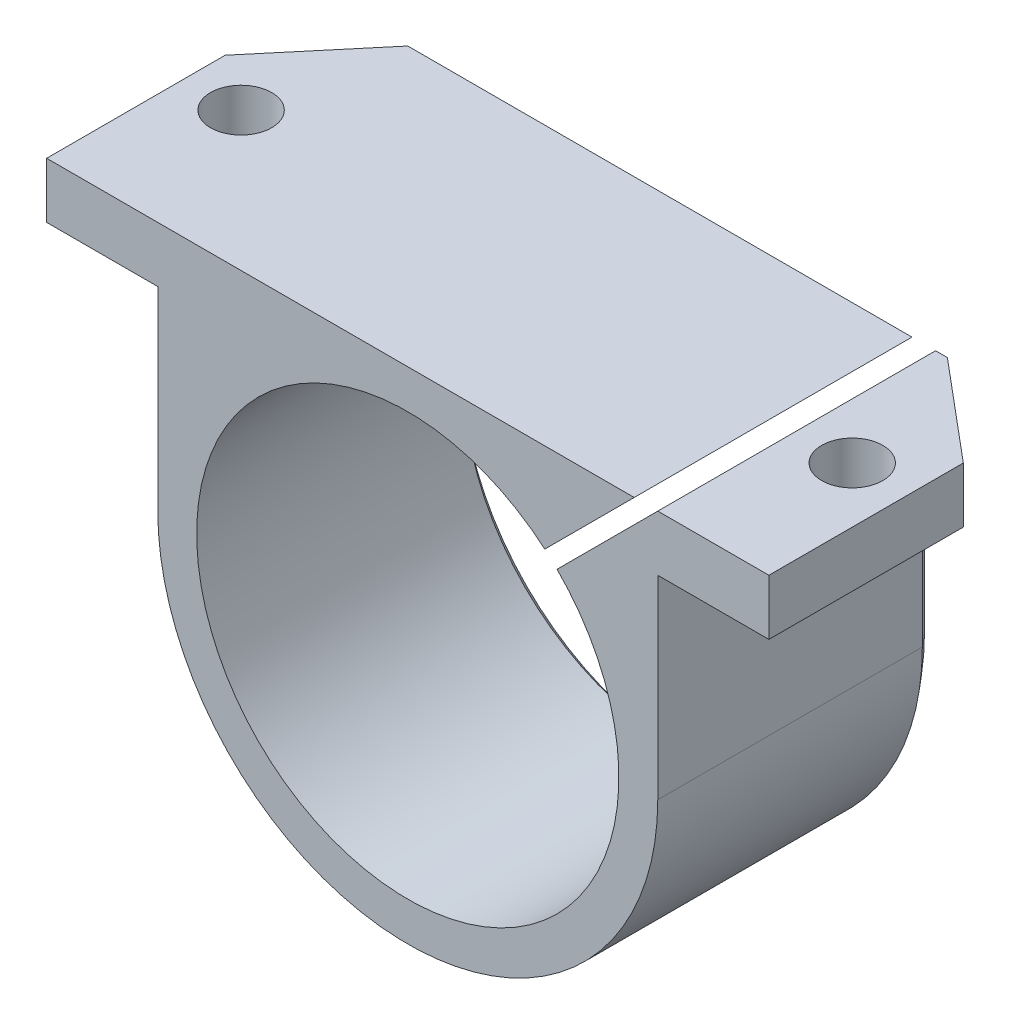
from build123d import *
from OCP.BRepFilletAPI import BRepFilletAPI_MakeChamfer

# Parameters (mm, degrees)
BOSS_EXTRUDE1_DEPTH = 12.5
SKETCH2_R           = 2.75
CUT_EXTRUDE1_DEPTH  = 57.899033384
CHAMFER1_SIZE       = 7.5
CHAMFER1_SIZE2      = 8.938151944
CHAMFER2_SIZE       = 1
CHAMFER2_SIZE2      = 1.191753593


with BuildPart() as part:
    # Sketch1 → Boss-Extrude1 (new, symmetric)
    with BuildSketch(Plane.XY):
        with BuildLine():
            Line((0, 19), (0, 22.5))
            ThreePointArc((0, 22.5), (-15.909902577, 15.909902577), (-22.5, 0))
            ThreePointArc((-22.5, 0), (0, -22.5), (22.5, 0))
            ThreePointArc((22.5, 0), (20.787289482, 8.610377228), (15.909902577, 15.909902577))
            Line((15.909902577, 15.909902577), (13.435028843, 13.435028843))
            ThreePointArc((13.435028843, 13.435028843), (17.553711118, 7.270985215), (19, 0))
            ThreePointArc((19, 0), (-13.435028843, -13.435028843), (0, 19))
        make_face()
        with BuildLine():
            ThreePointArc((14.813847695, 16.935168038), (7.912291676, 21.062897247), (0, 22.5))
            Line((0, 22.5), (0, 19))
            ThreePointArc((0, 19), (6.571858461, 17.827245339), (12.332435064, 14.453755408))
            Line((12.332435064, 14.453755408), (14.813847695, 16.935168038))
        make_face()
        with BuildLine():
            Line((20.378679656, 22.5), (0, 22.5))
            ThreePointArc((0, 22.5), (7.912291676, 21.062897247), (14.813847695, 16.935168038))
            Line((14.813847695, 16.935168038), (20.378679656, 22.5))
        make_face()
        with BuildLine():
            Line((32.5, 22.5), (22.5, 22.5))
            Line((22.5, 22.5), (15.909902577, 15.909902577))
            ThreePointArc((15.909902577, 15.909902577), (20.787289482, 8.610377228), (22.5, 0))
            Line((22.5, 0), (22.5, 17.5))
            Line((22.5, 17.5), (32.5, 17.5))
            Line((32.5, 17.5), (32.5, 22.5))
        make_face()
        with BuildLine():
            Line((0, 22.5), (-32.5, 22.5))
            Line((-32.5, 22.5), (-32.5, 17.5))
            Line((-32.5, 17.5), (-22.5, 17.5))
            Line((-22.5, 17.5), (-22.5, 0))
            ThreePointArc((-22.5, 0), (-15.909902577, 15.909902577), (0, 22.5))
        make_face()
    extrude(amount=BOSS_EXTRUDE1_DEPTH, both=True)

    # Sketch2 → Cut-Extrude1 (cut, through all)
    with BuildSketch(Plane(origin=(0, 22.5, 0), x_dir=(1, 0, 0), z_dir=(0, 1, 0))):
        with Locations(Location((27.5, 0, 0), (0, 0, 270))):
            Circle(SKETCH2_R)
        with Locations(Location((-27.5, 0, 0), (0, 0, 270))):
            Circle(SKETCH2_R)
    extrude(amount=-CUT_EXTRUDE1_DEPTH, mode=Mode.SUBTRACT)

    # Chamfer1: one chamfer whose edges measure the first distance from different faces: ONE call of the kernel's chamfer builder (chamfer() names one face for all edges)
    chamfer1_edges_1 = [part.edges().sort_by_distance(p)[0] for p in [
        (32.5, 20, -12.5),
    ]]
    chamfer1_side_1 = [part.faces().sort_by_distance(p)[0] for p in [
        (32.5, 20, 0),
    ]]
    chamfer1_edges_2 = [part.edges().sort_by_distance(p)[0] for p in [
        (-32.5, 20, -12.5),
    ]]
    chamfer1_side_2 = [part.faces().sort_by_distance(p)[0] for p in [
        (-20.634093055, 18.270282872, -12.5),
    ]]
    chamfer1 = BRepFilletAPI_MakeChamfer(part.part.solid().wrapped)
    for e in chamfer1_edges_1:
        chamfer1.Add(CHAMFER1_SIZE, CHAMFER1_SIZE2, e.wrapped, chamfer1_side_1[0].wrapped)  # the first distance lies on this face
    for e in chamfer1_edges_2:
        chamfer1.Add(CHAMFER1_SIZE, CHAMFER1_SIZE2, e.wrapped, chamfer1_side_2[0].wrapped)  # the first distance lies on this face
    add(Compound.cast(chamfer1.Shape()), mode=Mode.REPLACE)

    # Chamfer2: one chamfer whose edges measure the first distance from different faces: ONE call of the kernel's chamfer builder (chamfer() names one face for all edges)
    chamfer2_edges_1 = [part.edges().sort_by_distance(p)[0] for p in [
        (22.5, 8.75, -12.5),
        (0, -22.5, -12.5),
        (-22.5, 8.75, -12.5),
    ]]
    chamfer2_side_1 = [part.faces().sort_by_distance(p)[0] for p in [
        (-2.310660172, 21.837938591, -12.5),
    ]]
    chamfer2_edges_2 = [part.edges().sort_by_distance(p)[0] for p in [
        (-13.435028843, -13.435028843, -12.5),
    ]]
    chamfer2_side_2 = [part.faces().sort_by_distance(p)[0] for p in [
        (-13.435028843, -13.435028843, -6.25),
    ]]
    chamfer2 = BRepFilletAPI_MakeChamfer(part.part.solid().wrapped)
    for e in chamfer2_edges_1:
        chamfer2.Add(CHAMFER2_SIZE, CHAMFER2_SIZE2, e.wrapped, chamfer2_side_1[0].wrapped)  # the first distance lies on this face
    for e in chamfer2_edges_2:
        chamfer2.Add(CHAMFER2_SIZE, CHAMFER2_SIZE2, e.wrapped, chamfer2_side_2[0].wrapped)  # the first distance lies on this face
    add(Compound.cast(chamfer2.Shape()), mode=Mode.REPLACE)


solid = part.part
